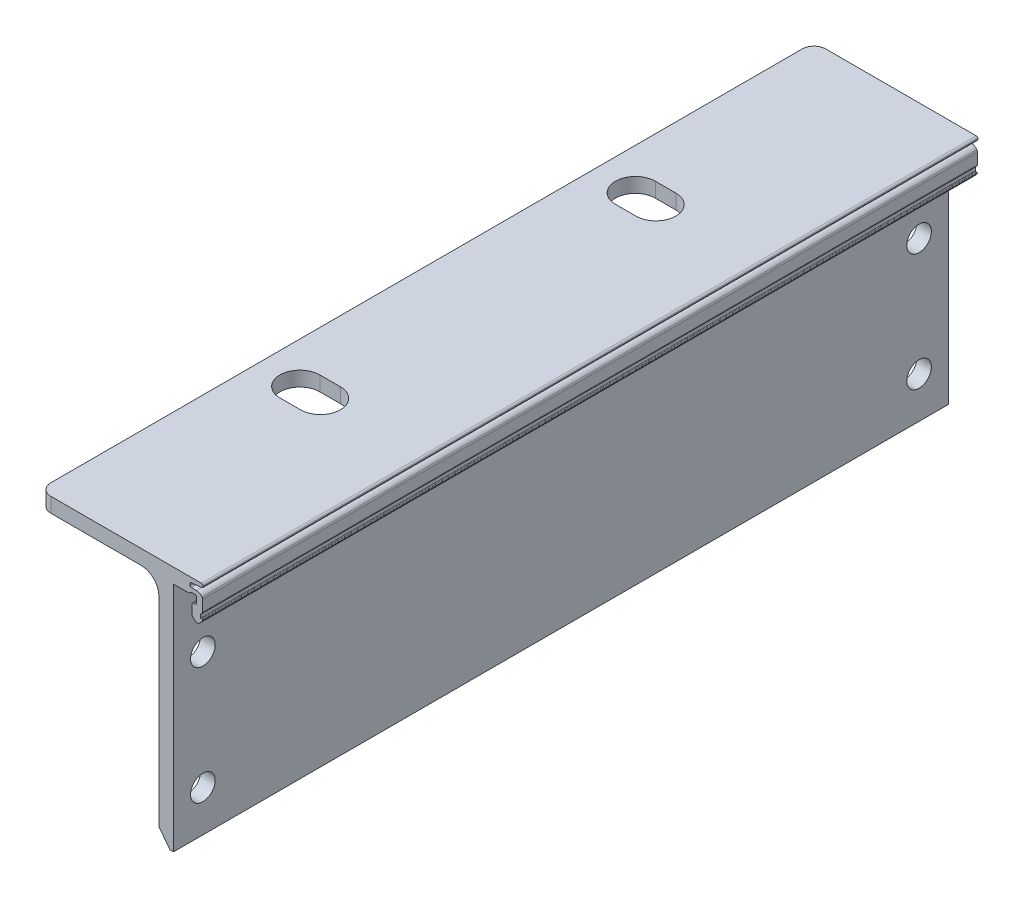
from build123d import *

# Parameters (mm, degrees)
EXTRUDE_1_DEPTH     = 66
FILLET_2_R          = 3
CUT_EXTRUDE_1_DEPTH = 2360.221429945
SKETCH_3_R          = 2.1
CUT_EXTRUDE_2_DEPTH = 3333.819781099
FILLET_1_R          = 2


with BuildPart() as part:
    # Sketch 1 → Extrude 1 (new, symmetric)
    with BuildSketch(Plane.XY):
        with BuildLine():
            Line((2329.984035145, -3290.103769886), (2355.384035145, -3290.103769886))
            Line((2355.384035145, -3290.103769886), (2357.624035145, -3290.103769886))
            ThreePointArc((2357.624035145, -3290.103769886), (2357.836167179, -3290.191637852), (2357.924035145, -3290.403769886))
            Line((2357.924035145, -3290.403769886), (2357.924035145, -3290.492459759))
            ThreePointArc((2357.924035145, -3290.492459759), (2357.87266411, -3290.626285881), (2357.744940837, -3290.691364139))
            Line((2357.744940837, -3290.691364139), (2355.903129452, -3290.884946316))
            ThreePointArc((2355.903129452, -3290.884946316), (2355.775406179, -3290.950024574), (2355.724035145, -3291.083850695))
            Line((2355.724035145, -3291.083850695), (2355.724035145, -3291.403769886))
            ThreePointArc((2355.724035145, -3291.403769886), (2355.782613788, -3291.545191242), (2355.924035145, -3291.603769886))
            Line((2355.924035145, -3291.603769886), (2356.769984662, -3291.603769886))
            ThreePointArc((2356.769984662, -3291.603769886), (2357.299096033, -3291.726717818), (2357.719785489, -3292.070367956))
            ThreePointArc((2357.719785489, -3292.070367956), (2357.797255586, -3292.214513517), (2357.824035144, -3292.375952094))
            Line((2357.824035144, -3292.375952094), (2357.824035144, -3294.273769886))
            ThreePointArc((2357.824035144, -3294.273769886), (2357.779946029, -3294.430325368), (2357.660637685, -3294.540864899))
            ThreePointArc((2357.660637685, -3294.540864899), (2357.54132934, -3294.65140443), (2357.497240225, -3294.807959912))
            Line((2357.497240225, -3294.807959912), (2357.497240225, -3295.307959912))
            ThreePointArc((2357.497240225, -3295.307959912), (2357.526529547, -3295.37867059), (2357.597240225, -3295.407959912))
            Line((2357.597240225, -3295.407959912), (2357.724035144, -3295.407959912))
            ThreePointArc((2357.724035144, -3295.407959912), (2357.794745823, -3295.437249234), (2357.824035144, -3295.507959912))
            Line((2357.824035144, -3295.507959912), (2357.824035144, -3295.527361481))
            ThreePointArc((2357.824035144, -3295.527361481), (2357.818000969, -3295.561572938), (2357.800626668, -3295.591655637))
            Line((2357.800626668, -3295.591655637), (2357.383057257, -3296.089092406))
            ThreePointArc((2357.383057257, -3296.089092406), (2356.924035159, -3296.303081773), (2356.465013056, -3296.089092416))
            Line((2356.465013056, -3296.089092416), (2356.094260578, -3295.647427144))
            ThreePointArc((2356.094260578, -3295.647427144), (2356.042137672, -3295.557179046), (2356.024035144, -3295.454544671))
            Line((2356.024035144, -3295.454544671), (2356.024035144, -3294.003769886))
            ThreePointArc((2356.024035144, -3294.003769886), (2356.11190311, -3293.791637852), (2356.324035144, -3293.703769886))
            Line((2356.324035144, -3293.703769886), (2356.524035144, -3293.703769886))
            ThreePointArc((2356.524035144, -3293.703769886), (2356.736167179, -3293.61590192), (2356.824035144, -3293.403769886))
            Line((2356.824035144, -3293.403769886), (2356.824035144, -3292.603769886))
            ThreePointArc((2356.824035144, -3292.603769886), (2356.736167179, -3292.391637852), (2356.524035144, -3292.303769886))
            Line((2356.524035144, -3292.303769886), (2355.987964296, -3292.303769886))
            ThreePointArc((2355.987964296, -3292.303769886), (2355.837964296, -3292.343962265), (2355.728156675, -3292.453769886))
            ThreePointArc((2355.728156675, -3292.453769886), (2355.618349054, -3292.563577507), (2355.468349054, -3292.603769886))
            Line((2355.468349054, -3292.603769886), (2355.384035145, -3292.603769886))
            Line((2355.384035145, -3292.603769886), (2352.884035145, -3292.603769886))
            Line((2352.884035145, -3292.603769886), (2352.884035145, -3332.103769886))
            Line((2352.884035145, -3332.103769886), (2352.284035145, -3332.103769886))
            Line((2352.284035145, -3332.103769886), (2350.384035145, -3329.603769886))
            Line((2350.384035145, -3329.603769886), (2350.384035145, -3292.603769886))
            Line((2350.384035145, -3292.603769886), (2329.984035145, -3292.603769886))
            Line((2329.984035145, -3292.603769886), (2329.984035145, -3290.103769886))
        make_face()
    extrude(amount=EXTRUDE_1_DEPTH, both=True)

    # Fillet 2
    fillet_2_edges = [part.edges().sort_by_distance(p)[0] for p in [
        (2350.384035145, -3292.603769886, 0),
    ]]
    fillet(fillet_2_edges, radius=FILLET_2_R)

    # Sketch 2 → Cut-Extrude 1 (cut, through all)
    with BuildSketch(Plane(origin=(0, -3290.103769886, 0), x_dir=(1, 0, 0), z_dir=(0, 1, 0))):
        with BuildLine():
            Line((2340.484035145, -25.175), (2336.984035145, -25.175))
            ThreePointArc((2336.984035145, -25.175), (2333.584035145, -28.575), (2336.984035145, -31.975))
            Line((2336.984035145, -31.975), (2340.484035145, -31.975))
            ThreePointArc((2340.484035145, -31.975), (2343.884035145, -28.575), (2340.484035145, -25.175))
        make_face()
        with BuildLine():
            Line((2340.484035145, 31.975), (2336.984035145, 31.975))
            ThreePointArc((2336.984035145, 31.975), (2333.584035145, 28.575), (2336.984035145, 25.175))
            Line((2336.984035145, 25.175), (2340.484035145, 25.175))
            ThreePointArc((2340.484035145, 25.175), (2343.884035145, 28.575), (2340.484035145, 31.975))
        make_face()
    extrude(amount=-CUT_EXTRUDE_1_DEPTH, mode=Mode.SUBTRACT)

    # Sketch 3 → Cut-Extrude 2 (cut, through all)
    with BuildSketch(Plane.ZY.offset(-2350.384035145)):
        with Locations(Location((-61, -3305.103769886, 0), (0, 0, 270))):
            Circle(SKETCH_3_R)
        with Locations(Location((-61, -3325.103769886, 0), (0, 0, 270))):
            Circle(SKETCH_3_R)
        with Locations((61, -3305.103769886)):
            Circle(SKETCH_3_R)
        with Locations((61, -3325.103769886)):
            Circle(SKETCH_3_R)
    extrude(amount=-CUT_EXTRUDE_2_DEPTH, mode=Mode.SUBTRACT)

    # Fillet 1
    fillet_1_edges = [part.edges().sort_by_distance(p)[0] for p in [
        (2329.984035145, -3291.353769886, 66),
        (2329.984035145, -3291.353769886, -66),
    ]]
    fillet(fillet_1_edges, radius=FILLET_1_R)


solid = part.part
